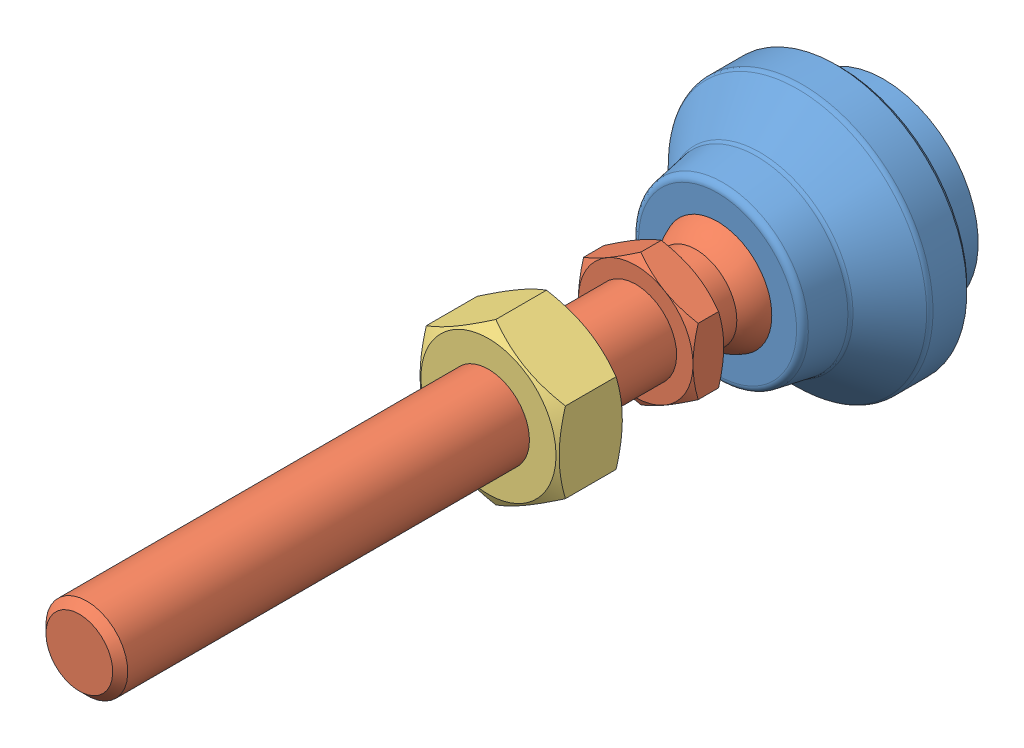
SolidWorks assembly LSVA32-M10X68.sldasm, configuration Default (file format 15000). Lengths in mm.
Overall size (32 32 98.3).
3 component instances, 3 part files, 0 mates.
Components (placement in the parent):
- LSVA32-M10X68_01-1: LSVA32-M10X68_01.SLDPRT [Default] at (0 0 5.3) x (1 0 0) z (0 -1 0) size (32 20.3 32)
- LSVA32-M10X68_02-1: LSVA32-M10X68_02.sldprt [Default] at (0 0 18.05) x (1 0 0) z (0 -1 0) size (14 87.25 16.17)
- LSVA32-M10X68_03-1: LSVA32-M10X68_03.sldprt [Default] at (0 0 40.3) size (17 19.63 8)
